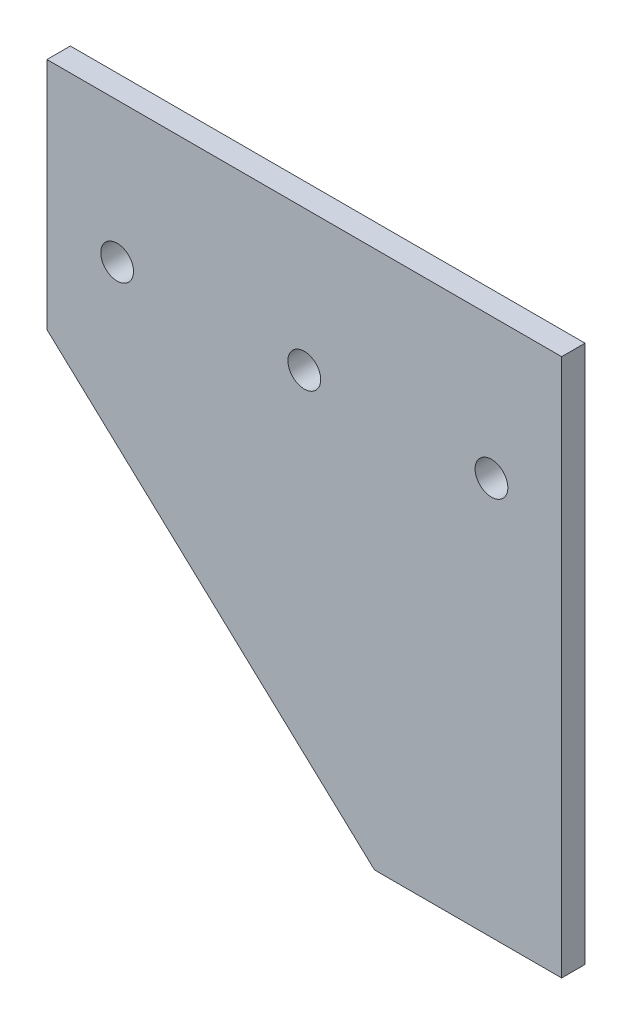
ISO-10303-21;
HEADER;
FILE_DESCRIPTION(('STEP AP214'),'2;1');
FILE_NAME('part.step','',(''),(''),'','','');
FILE_SCHEMA(('AUTOMOTIVE_DESIGN { 1 0 10303 214 1 1 1 1 }'));
ENDSEC;
DATA;
#1=APPLICATION_CONTEXT('core data for automotive mechanical design processes');
#2=APPLICATION_PROTOCOL_DEFINITION('international standard','automotive_design',2000,#1);
#3=PRODUCT_CONTEXT('',#1,'mechanical');
#4=PRODUCT('Part','Part','',(#3));
#5=PRODUCT_RELATED_PRODUCT_CATEGORY('part','',(#4));
#6=PRODUCT_DEFINITION_FORMATION('','',#4);
#7=PRODUCT_DEFINITION_CONTEXT('part definition',#1,'design');
#8=PRODUCT_DEFINITION('design','',#6,#7);
#9=PRODUCT_DEFINITION_SHAPE('','',#8);
#10=(LENGTH_UNIT() NAMED_UNIT(*) SI_UNIT(.MILLI.,.METRE.));
#11=(NAMED_UNIT(*) PLANE_ANGLE_UNIT() SI_UNIT($,.RADIAN.));
#12=(NAMED_UNIT(*) SI_UNIT($,.STERADIAN.) SOLID_ANGLE_UNIT());
#13=UNCERTAINTY_MEASURE_WITH_UNIT(LENGTH_MEASURE(1.E-05),#10,'distance_accuracy_value','');
#14=(GEOMETRIC_REPRESENTATION_CONTEXT(3) GLOBAL_UNCERTAINTY_ASSIGNED_CONTEXT((#13)) GLOBAL_UNIT_ASSIGNED_CONTEXT((#10,
#11,#12)) REPRESENTATION_CONTEXT('',''));
#15=CARTESIAN_POINT('',(0.,0.,0.));
#16=DIRECTION('',(0.,0.,1.));
#17=DIRECTION('',(1.,0.,0.));
#18=AXIS2_PLACEMENT_3D('',#15,#16,#17);
#19=CARTESIAN_POINT('',(-110.,115.,10.));
#20=DIRECTION('',(0.,0.,1.));
#21=DIRECTION('',(1.,0.,0.));
#22=AXIS2_PLACEMENT_3D('',#19,#20,#21);
#23=PLANE('',#22);
#24=CARTESIAN_POINT('',(80.,55.,10.));
#25=DIRECTION('',(0.,0.,1.));
#26=DIRECTION('',(1.,0.,0.));
#27=AXIS2_PLACEMENT_3D('',#24,#25,#26);
#28=CIRCLE('',#27,6.99999999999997);
#29=CARTESIAN_POINT('',(87.,55.,10.));
#30=VERTEX_POINT('',#29);
#31=EDGE_CURVE('E139',#30,#30,#28,.T.);
#32=ORIENTED_EDGE('',*,*,#31,.F.);
#33=EDGE_LOOP('',(#32));
#34=FACE_BOUND('',#33,.T.);
#35=DIRECTION('',(0.,-1.,0.));
#36=VECTOR('',#35,1.);
#37=CARTESIAN_POINT('',(-110.,115.,10.));
#38=LINE('',#37,#36);
#39=CARTESIAN_POINT('',(-110.,115.,10.));
#40=VERTEX_POINT('',#39);
#41=CARTESIAN_POINT('',(-110.,15.,10.));
#42=VERTEX_POINT('',#41);
#43=EDGE_CURVE('E108',#40,#42,#38,.T.);
#44=ORIENTED_EDGE('',*,*,#43,.T.);
#45=DIRECTION('',(0.732793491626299,-0.680451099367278,0.));
#46=VECTOR('',#45,1.);
#47=CARTESIAN_POINT('',(-110.,15.,10.));
#48=LINE('',#47,#46);
#49=CARTESIAN_POINT('',(30.,-115.,10.));
#50=VERTEX_POINT('',#49);
#51=EDGE_CURVE('E91',#42,#50,#48,.T.);
#52=ORIENTED_EDGE('',*,*,#51,.T.);
#53=DIRECTION('',(1.,0.,0.));
#54=VECTOR('',#53,1.);
#55=CARTESIAN_POINT('',(30.,-115.,10.));
#56=LINE('',#55,#54);
#57=CARTESIAN_POINT('',(110.,-115.,10.));
#58=VERTEX_POINT('',#57);
#59=EDGE_CURVE('E111',#50,#58,#56,.T.);
#60=ORIENTED_EDGE('',*,*,#59,.T.);
#61=DIRECTION('',(0.,1.,0.));
#62=VECTOR('',#61,1.);
#63=CARTESIAN_POINT('',(110.,115.,10.));
#64=LINE('',#63,#62);
#65=CARTESIAN_POINT('',(110.,115.,10.));
#66=VERTEX_POINT('',#65);
#67=EDGE_CURVE('E50',#58,#66,#64,.T.);
#68=ORIENTED_EDGE('',*,*,#67,.T.);
#69=DIRECTION('',(-1.,0.,0.));
#70=VECTOR('',#69,1.);
#71=CARTESIAN_POINT('',(-110.,115.,10.));
#72=LINE('',#71,#70);
#73=EDGE_CURVE('E45',#66,#40,#72,.T.);
#74=ORIENTED_EDGE('',*,*,#73,.T.);
#75=EDGE_LOOP('',(#44,#52,#60,#68,#74));
#76=FACE_BOUND('',#75,.T.);
#77=CARTESIAN_POINT('',(-80.,55.,10.));
#78=DIRECTION('',(0.,0.,1.));
#79=DIRECTION('',(1.,0.,0.));
#80=AXIS2_PLACEMENT_3D('',#77,#78,#79);
#81=CIRCLE('',#80,7.);
#82=CARTESIAN_POINT('',(-73.,55.,10.));
#83=VERTEX_POINT('',#82);
#84=EDGE_CURVE('E96',#83,#83,#81,.T.);
#85=ORIENTED_EDGE('',*,*,#84,.F.);
#86=EDGE_LOOP('',(#85));
#87=FACE_BOUND('',#86,.T.);
#88=CARTESIAN_POINT('',(0.,55.,10.));
#89=DIRECTION('',(0.,0.,1.));
#90=DIRECTION('',(1.,0.,0.));
#91=AXIS2_PLACEMENT_3D('',#88,#89,#90);
#92=CIRCLE('',#91,6.99999999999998);
#93=CARTESIAN_POINT('',(7.00000000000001,55.,10.));
#94=VERTEX_POINT('',#93);
#95=EDGE_CURVE('E133',#94,#94,#92,.T.);
#96=ORIENTED_EDGE('',*,*,#95,.F.);
#97=EDGE_LOOP('',(#96));
#98=FACE_BOUND('',#97,.T.);
#99=ADVANCED_FACE('F30',(#34,#76,#87,#98),#23,.T.);
#100=CARTESIAN_POINT('',(-110.,115.,0.));
#101=DIRECTION('',(0.,0.,1.));
#102=DIRECTION('',(1.,0.,0.));
#103=AXIS2_PLACEMENT_3D('',#100,#101,#102);
#104=PLANE('',#103);
#105=CARTESIAN_POINT('',(80.,55.,0.));
#106=DIRECTION('',(0.,0.,1.));
#107=DIRECTION('',(1.,0.,0.));
#108=AXIS2_PLACEMENT_3D('',#105,#106,#107);
#109=CIRCLE('',#108,6.99999999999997);
#110=CARTESIAN_POINT('',(87.,55.,0.));
#111=VERTEX_POINT('',#110);
#112=EDGE_CURVE('E135',#111,#111,#109,.T.);
#113=ORIENTED_EDGE('',*,*,#112,.T.);
#114=EDGE_LOOP('',(#113));
#115=FACE_BOUND('',#114,.T.);
#116=DIRECTION('',(0.,-1.,0.));
#117=VECTOR('',#116,1.);
#118=CARTESIAN_POINT('',(-110.,115.,0.));
#119=LINE('',#118,#117);
#120=CARTESIAN_POINT('',(-110.,115.,0.));
#121=VERTEX_POINT('',#120);
#122=CARTESIAN_POINT('',(-110.,15.,0.));
#123=VERTEX_POINT('',#122);
#124=EDGE_CURVE('E82',#121,#123,#119,.T.);
#125=ORIENTED_EDGE('',*,*,#124,.F.);
#126=DIRECTION('',(-1.,0.,0.));
#127=VECTOR('',#126,1.);
#128=CARTESIAN_POINT('',(-110.,115.,0.));
#129=LINE('',#128,#127);
#130=CARTESIAN_POINT('',(110.,115.,0.));
#131=VERTEX_POINT('',#130);
#132=EDGE_CURVE('E106',#131,#121,#129,.T.);
#133=ORIENTED_EDGE('',*,*,#132,.F.);
#134=DIRECTION('',(0.,1.,0.));
#135=VECTOR('',#134,1.);
#136=CARTESIAN_POINT('',(110.,115.,0.));
#137=LINE('',#136,#135);
#138=CARTESIAN_POINT('',(110.,-115.,0.));
#139=VERTEX_POINT('',#138);
#140=EDGE_CURVE('E104',#139,#131,#137,.T.);
#141=ORIENTED_EDGE('',*,*,#140,.F.);
#142=DIRECTION('',(1.,0.,0.));
#143=VECTOR('',#142,1.);
#144=CARTESIAN_POINT('',(30.,-115.,0.));
#145=LINE('',#144,#143);
#146=CARTESIAN_POINT('',(30.,-115.,0.));
#147=VERTEX_POINT('',#146);
#148=EDGE_CURVE('E84',#147,#139,#145,.T.);
#149=ORIENTED_EDGE('',*,*,#148,.F.);
#150=DIRECTION('',(0.732793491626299,-0.680451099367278,0.));
#151=VECTOR('',#150,1.);
#152=CARTESIAN_POINT('',(-110.,15.,0.));
#153=LINE('',#152,#151);
#154=EDGE_CURVE('E77',#123,#147,#153,.T.);
#155=ORIENTED_EDGE('',*,*,#154,.F.);
#156=EDGE_LOOP('',(#125,#133,#141,#149,#155));
#157=FACE_BOUND('',#156,.T.);
#158=CARTESIAN_POINT('',(-80.,55.,0.));
#159=DIRECTION('',(0.,0.,1.));
#160=DIRECTION('',(1.,0.,0.));
#161=AXIS2_PLACEMENT_3D('',#158,#159,#160);
#162=CIRCLE('',#161,7.);
#163=CARTESIAN_POINT('',(-73.,55.,0.));
#164=VERTEX_POINT('',#163);
#165=EDGE_CURVE('E99',#164,#164,#162,.T.);
#166=ORIENTED_EDGE('',*,*,#165,.T.);
#167=EDGE_LOOP('',(#166));
#168=FACE_BOUND('',#167,.T.);
#169=CARTESIAN_POINT('',(0.,55.,0.));
#170=DIRECTION('',(0.,0.,1.));
#171=DIRECTION('',(1.,0.,0.));
#172=AXIS2_PLACEMENT_3D('',#169,#170,#171);
#173=CIRCLE('',#172,6.99999999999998);
#174=CARTESIAN_POINT('',(7.00000000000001,55.,0.));
#175=VERTEX_POINT('',#174);
#176=EDGE_CURVE('E136',#175,#175,#173,.T.);
#177=ORIENTED_EDGE('',*,*,#176,.T.);
#178=EDGE_LOOP('',(#177));
#179=FACE_BOUND('',#178,.T.);
#180=ADVANCED_FACE('F78',(#115,#157,#168,#179),#104,.F.);
#181=CARTESIAN_POINT('',(-110.,115.,10.));
#182=DIRECTION('',(1.,0.,0.));
#183=DIRECTION('',(0.,1.,0.));
#184=AXIS2_PLACEMENT_3D('',#181,#182,#183);
#185=PLANE('',#184);
#186=ORIENTED_EDGE('',*,*,#124,.T.);
#187=DIRECTION('',(0.,0.,-1.));
#188=VECTOR('',#187,1.);
#189=CARTESIAN_POINT('',(-110.,15.,10.));
#190=LINE('',#189,#188);
#191=EDGE_CURVE('E11',#42,#123,#190,.T.);
#192=ORIENTED_EDGE('',*,*,#191,.F.);
#193=ORIENTED_EDGE('',*,*,#43,.F.);
#194=DIRECTION('',(0.,0.,-1.));
#195=VECTOR('',#194,1.);
#196=CARTESIAN_POINT('',(-110.,115.,10.));
#197=LINE('',#196,#195);
#198=EDGE_CURVE('E95',#40,#121,#197,.T.);
#199=ORIENTED_EDGE('',*,*,#198,.T.);
#200=EDGE_LOOP('',(#186,#192,#193,#199));
#201=FACE_BOUND('',#200,.T.);
#202=ADVANCED_FACE('F32',(#201),#185,.F.);
#203=CARTESIAN_POINT('',(-110.,15.,10.));
#204=DIRECTION('',(0.680451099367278,0.732793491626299,0.));
#205=DIRECTION('',(-0.732793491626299,0.680451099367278,0.));
#206=AXIS2_PLACEMENT_3D('',#203,#204,#205);
#207=PLANE('',#206);
#208=ORIENTED_EDGE('',*,*,#154,.T.);
#209=DIRECTION('',(0.,0.,-1.));
#210=VECTOR('',#209,1.);
#211=CARTESIAN_POINT('',(30.,-115.,10.));
#212=LINE('',#211,#210);
#213=EDGE_CURVE('E38',#50,#147,#212,.T.);
#214=ORIENTED_EDGE('',*,*,#213,.F.);
#215=ORIENTED_EDGE('',*,*,#51,.F.);
#216=ORIENTED_EDGE('',*,*,#191,.T.);
#217=EDGE_LOOP('',(#208,#214,#215,#216));
#218=FACE_BOUND('',#217,.T.);
#219=ADVANCED_FACE('F90',(#218),#207,.F.);
#220=CARTESIAN_POINT('',(30.,-115.,10.));
#221=DIRECTION('',(0.,1.,0.));
#222=DIRECTION('',(0.,0.,1.));
#223=AXIS2_PLACEMENT_3D('',#220,#221,#222);
#224=PLANE('',#223);
#225=ORIENTED_EDGE('',*,*,#148,.T.);
#226=DIRECTION('',(0.,0.,-1.));
#227=VECTOR('',#226,1.);
#228=CARTESIAN_POINT('',(110.,-115.,10.));
#229=LINE('',#228,#227);
#230=EDGE_CURVE('E119',#58,#139,#229,.T.);
#231=ORIENTED_EDGE('',*,*,#230,.F.);
#232=ORIENTED_EDGE('',*,*,#59,.F.);
#233=ORIENTED_EDGE('',*,*,#213,.T.);
#234=EDGE_LOOP('',(#225,#231,#232,#233));
#235=FACE_BOUND('',#234,.T.);
#236=ADVANCED_FACE('F123',(#235),#224,.F.);
#237=CARTESIAN_POINT('',(110.,115.,10.));
#238=DIRECTION('',(-1.,0.,0.));
#239=DIRECTION('',(0.,-1.,0.));
#240=AXIS2_PLACEMENT_3D('',#237,#238,#239);
#241=PLANE('',#240);
#242=ORIENTED_EDGE('',*,*,#140,.T.);
#243=DIRECTION('',(0.,0.,-1.));
#244=VECTOR('',#243,1.);
#245=CARTESIAN_POINT('',(110.,115.,10.));
#246=LINE('',#245,#244);
#247=EDGE_CURVE('E116',#66,#131,#246,.T.);
#248=ORIENTED_EDGE('',*,*,#247,.F.);
#249=ORIENTED_EDGE('',*,*,#67,.F.);
#250=ORIENTED_EDGE('',*,*,#230,.T.);
#251=EDGE_LOOP('',(#242,#248,#249,#250));
#252=FACE_BOUND('',#251,.T.);
#253=ADVANCED_FACE('F162',(#252),#241,.F.);
#254=CARTESIAN_POINT('',(-110.,115.,10.));
#255=DIRECTION('',(0.,-1.,0.));
#256=DIRECTION('',(1.,0.,0.));
#257=AXIS2_PLACEMENT_3D('',#254,#255,#256);
#258=PLANE('',#257);
#259=ORIENTED_EDGE('',*,*,#132,.T.);
#260=ORIENTED_EDGE('',*,*,#198,.F.);
#261=ORIENTED_EDGE('',*,*,#73,.F.);
#262=ORIENTED_EDGE('',*,*,#247,.T.);
#263=EDGE_LOOP('',(#259,#260,#261,#262));
#264=FACE_BOUND('',#263,.T.);
#265=ADVANCED_FACE('F152',(#264),#258,.F.);
#266=CARTESIAN_POINT('',(-80.,55.,10.));
#267=DIRECTION('',(0.,0.,-1.));
#268=DIRECTION('',(-1.,0.,0.));
#269=AXIS2_PLACEMENT_3D('',#266,#267,#268);
#270=CYLINDRICAL_SURFACE('',#269,7.);
#271=ORIENTED_EDGE('',*,*,#84,.T.);
#272=EDGE_LOOP('',(#271));
#273=FACE_BOUND('',#272,.T.);
#274=ORIENTED_EDGE('',*,*,#165,.F.);
#275=EDGE_LOOP('',(#274));
#276=FACE_BOUND('',#275,.T.);
#277=ADVANCED_FACE('F149',(#273,#276),#270,.F.);
#278=CARTESIAN_POINT('',(80.,55.,10.));
#279=DIRECTION('',(0.,0.,-1.));
#280=DIRECTION('',(-1.,0.,0.));
#281=AXIS2_PLACEMENT_3D('',#278,#279,#280);
#282=CYLINDRICAL_SURFACE('',#281,6.99999999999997);
#283=ORIENTED_EDGE('',*,*,#31,.T.);
#284=EDGE_LOOP('',(#283));
#285=FACE_BOUND('',#284,.T.);
#286=ORIENTED_EDGE('',*,*,#112,.F.);
#287=EDGE_LOOP('',(#286));
#288=FACE_BOUND('',#287,.T.);
#289=ADVANCED_FACE('F151',(#285,#288),#282,.F.);
#290=CARTESIAN_POINT('',(0.,55.,10.));
#291=DIRECTION('',(0.,0.,-1.));
#292=DIRECTION('',(-1.,0.,0.));
#293=AXIS2_PLACEMENT_3D('',#290,#291,#292);
#294=CYLINDRICAL_SURFACE('',#293,6.99999999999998);
#295=ORIENTED_EDGE('',*,*,#95,.T.);
#296=EDGE_LOOP('',(#295));
#297=FACE_BOUND('',#296,.T.);
#298=ORIENTED_EDGE('',*,*,#176,.F.);
#299=EDGE_LOOP('',(#298));
#300=FACE_BOUND('',#299,.T.);
#301=ADVANCED_FACE('F159',(#297,#300),#294,.F.);
#302=CLOSED_SHELL('',(#99,#180,#202,#219,#236,#253,#265,#277,#289,#301));
#303=MANIFOLD_SOLID_BREP('B2',#302);
#304=ADVANCED_BREP_SHAPE_REPRESENTATION('',(#18,#303),#14);
#305=SHAPE_DEFINITION_REPRESENTATION(#9,#304);
ENDSEC;
END-ISO-10303-21;
